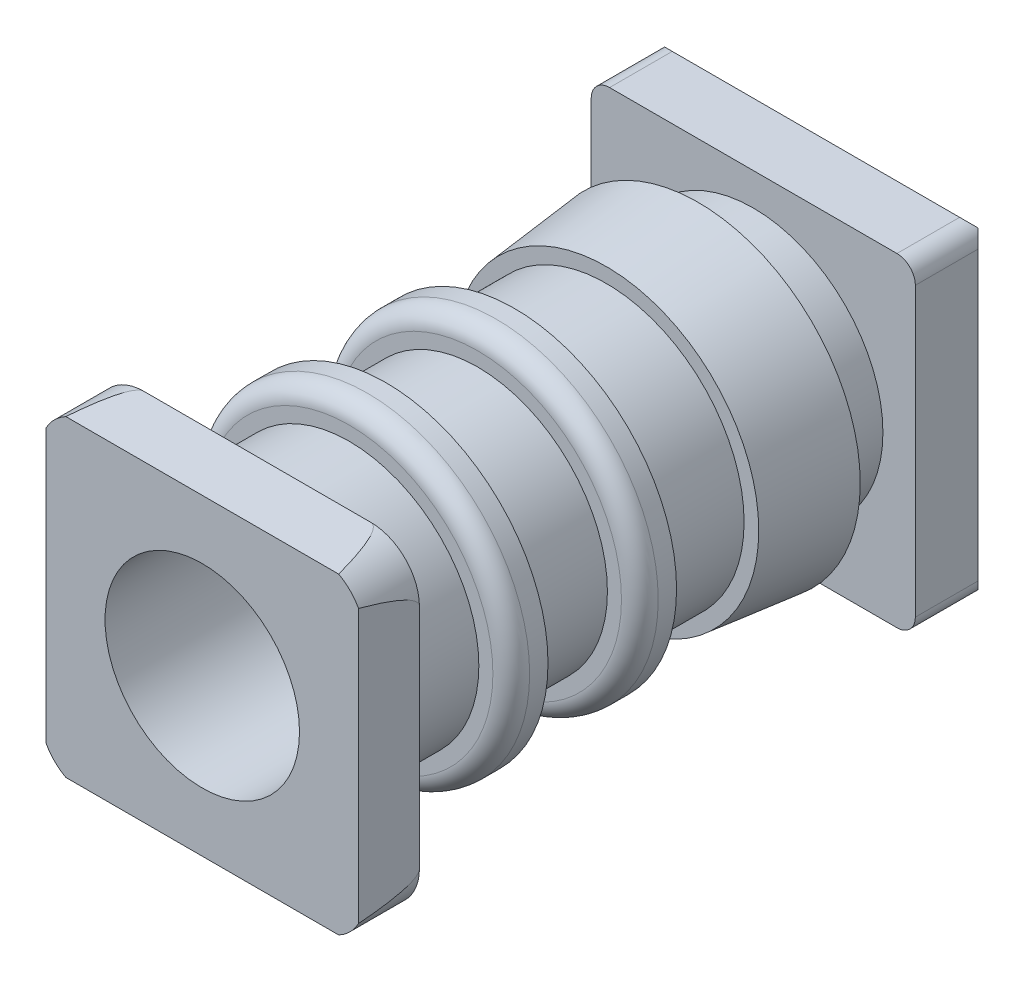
ISO-10303-21;
HEADER;
FILE_DESCRIPTION(('STEP AP214'),'2;1');
FILE_NAME('part.step','',(''),(''),'','','');
FILE_SCHEMA(('AUTOMOTIVE_DESIGN { 1 0 10303 214 1 1 1 1 }'));
ENDSEC;
DATA;
#1=APPLICATION_CONTEXT('core data for automotive mechanical design processes');
#2=APPLICATION_PROTOCOL_DEFINITION('international standard','automotive_design',2000,#1);
#3=PRODUCT_CONTEXT('',#1,'mechanical');
#4=PRODUCT('Part','Part','',(#3));
#5=PRODUCT_RELATED_PRODUCT_CATEGORY('part','',(#4));
#6=PRODUCT_DEFINITION_FORMATION('','',#4);
#7=PRODUCT_DEFINITION_CONTEXT('part definition',#1,'design');
#8=PRODUCT_DEFINITION('design','',#6,#7);
#9=PRODUCT_DEFINITION_SHAPE('','',#8);
#10=(LENGTH_UNIT() NAMED_UNIT(*) SI_UNIT(.MILLI.,.METRE.));
#11=(NAMED_UNIT(*) PLANE_ANGLE_UNIT() SI_UNIT($,.RADIAN.));
#12=(NAMED_UNIT(*) SI_UNIT($,.STERADIAN.) SOLID_ANGLE_UNIT());
#13=UNCERTAINTY_MEASURE_WITH_UNIT(LENGTH_MEASURE(1.E-05),#10,'distance_accuracy_value','');
#14=(GEOMETRIC_REPRESENTATION_CONTEXT(3) GLOBAL_UNCERTAINTY_ASSIGNED_CONTEXT((#13)) GLOBAL_UNIT_ASSIGNED_CONTEXT((#10,
#11,#12)) REPRESENTATION_CONTEXT('',''));
#15=CARTESIAN_POINT('',(0.,0.,0.));
#16=DIRECTION('',(0.,0.,1.));
#17=DIRECTION('',(1.,0.,0.));
#18=AXIS2_PLACEMENT_3D('',#15,#16,#17);
#19=CARTESIAN_POINT('',(-10.,10.,30.6));
#20=DIRECTION('',(0.,0.,-1.));
#21=DIRECTION('',(1.,0.,0.));
#22=AXIS2_PLACEMENT_3D('',#19,#20,#21);
#23=PLANE('',#22);
#24=CARTESIAN_POINT('',(0.,0.,30.6));
#25=DIRECTION('',(0.,0.,-1.));
#26=DIRECTION('',(1.,0.,0.));
#27=AXIS2_PLACEMENT_3D('',#24,#25,#26);
#28=CIRCLE('',#27,8.);
#29=CARTESIAN_POINT('',(8.,0.,30.6));
#30=VERTEX_POINT('',#29);
#31=EDGE_CURVE('E289',#30,#30,#28,.F.);
#32=ORIENTED_EDGE('',*,*,#31,.T.);
#33=EDGE_LOOP('',(#32));
#34=FACE_BOUND('',#33,.T.);
#35=CARTESIAN_POINT('',(7.,-7.,30.6));
#36=DIRECTION('',(0.,0.,-1.));
#37=DIRECTION('',(1.,0.,0.));
#38=AXIS2_PLACEMENT_3D('',#35,#36,#37);
#39=CIRCLE('',#38,3.);
#40=CARTESIAN_POINT('',(7.,-10.,30.6));
#41=VERTEX_POINT('',#40);
#42=CARTESIAN_POINT('',(10.,-7.,30.6));
#43=VERTEX_POINT('',#42);
#44=EDGE_CURVE('E396',#41,#43,#39,.F.);
#45=ORIENTED_EDGE('',*,*,#44,.F.);
#46=DIRECTION('',(-1.,0.,0.));
#47=VECTOR('',#46,1.);
#48=CARTESIAN_POINT('',(-10.,-10.,30.6));
#49=LINE('',#48,#47);
#50=CARTESIAN_POINT('',(-7.,-10.,30.6));
#51=VERTEX_POINT('',#50);
#52=EDGE_CURVE('E239',#51,#41,#49,.F.);
#53=ORIENTED_EDGE('',*,*,#52,.F.);
#54=CARTESIAN_POINT('',(-7.,-7.,30.6));
#55=DIRECTION('',(0.,0.,-1.));
#56=DIRECTION('',(1.,0.,0.));
#57=AXIS2_PLACEMENT_3D('',#54,#55,#56);
#58=CIRCLE('',#57,3.);
#59=CARTESIAN_POINT('',(-10.,-7.,30.6));
#60=VERTEX_POINT('',#59);
#61=EDGE_CURVE('E175',#60,#51,#58,.F.);
#62=ORIENTED_EDGE('',*,*,#61,.F.);
#63=DIRECTION('',(0.,-1.,0.));
#64=VECTOR('',#63,1.);
#65=CARTESIAN_POINT('',(-10.,-10.,30.6));
#66=LINE('',#65,#64);
#67=CARTESIAN_POINT('',(-10.,7.,30.6));
#68=VERTEX_POINT('',#67);
#69=EDGE_CURVE('E241',#60,#68,#66,.F.);
#70=ORIENTED_EDGE('',*,*,#69,.T.);
#71=CARTESIAN_POINT('',(-7.,7.,30.6));
#72=DIRECTION('',(0.,0.,-1.));
#73=DIRECTION('',(1.,0.,0.));
#74=AXIS2_PLACEMENT_3D('',#71,#72,#73);
#75=CIRCLE('',#74,3.);
#76=CARTESIAN_POINT('',(-7.,10.,30.6));
#77=VERTEX_POINT('',#76);
#78=EDGE_CURVE('E31',#77,#68,#75,.F.);
#79=ORIENTED_EDGE('',*,*,#78,.F.);
#80=DIRECTION('',(-1.,0.,0.));
#81=VECTOR('',#80,1.);
#82=CARTESIAN_POINT('',(-10.,10.,30.6));
#83=LINE('',#82,#81);
#84=CARTESIAN_POINT('',(7.,10.,30.6));
#85=VERTEX_POINT('',#84);
#86=EDGE_CURVE('E244',#85,#77,#83,.T.);
#87=ORIENTED_EDGE('',*,*,#86,.F.);
#88=CARTESIAN_POINT('',(7.,7.,30.6));
#89=DIRECTION('',(0.,0.,-1.));
#90=DIRECTION('',(1.,0.,0.));
#91=AXIS2_PLACEMENT_3D('',#88,#89,#90);
#92=CIRCLE('',#91,3.);
#93=CARTESIAN_POINT('',(10.,7.,30.6));
#94=VERTEX_POINT('',#93);
#95=EDGE_CURVE('E413',#94,#85,#92,.F.);
#96=ORIENTED_EDGE('',*,*,#95,.F.);
#97=DIRECTION('',(0.,-1.,0.));
#98=VECTOR('',#97,1.);
#99=CARTESIAN_POINT('',(10.,-10.,30.6));
#100=LINE('',#99,#98);
#101=EDGE_CURVE('E247',#94,#43,#100,.T.);
#102=ORIENTED_EDGE('',*,*,#101,.T.);
#103=EDGE_LOOP('',(#45,#53,#62,#70,#79,#87,#96,#102));
#104=FACE_BOUND('',#103,.T.);
#105=ADVANCED_FACE('F14',(#34,#104),#23,.T.);
#106=CARTESIAN_POINT('',(0.,-4.,34.));
#107=DIRECTION('',(0.,0.,1.));
#108=DIRECTION('',(-1.,0.,0.));
#109=AXIS2_PLACEMENT_3D('',#106,#107,#108);
#110=PLANE('',#109);
#111=CARTESIAN_POINT('',(0.,0.,34.));
#112=DIRECTION('',(0.,0.,-1.));
#113=DIRECTION('',(1.,0.,0.));
#114=AXIS2_PLACEMENT_3D('',#111,#112,#113);
#115=CIRCLE('',#114,6.);
#116=CARTESIAN_POINT('',(6.,0.,34.));
#117=VERTEX_POINT('',#116);
#118=EDGE_CURVE('E417',#117,#117,#115,.T.);
#119=ORIENTED_EDGE('',*,*,#118,.T.);
#120=EDGE_LOOP('',(#119));
#121=FACE_BOUND('',#120,.T.);
#122=CARTESIAN_POINT('',(7.,-7.,34.));
#123=DIRECTION('',(0.,0.,-1.));
#124=DIRECTION('',(-1.,0.,0.));
#125=AXIS2_PLACEMENT_3D('',#122,#123,#124);
#126=CIRCLE('',#125,3.);
#127=CARTESIAN_POINT('',(9.6426456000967,-8.42000853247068,34.));
#128=VERTEX_POINT('',#127);
#129=CARTESIAN_POINT('',(8.42000853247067,-9.6426456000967,34.));
#130=VERTEX_POINT('',#129);
#131=EDGE_CURVE('E38',#128,#130,#126,.T.);
#132=ORIENTED_EDGE('',*,*,#131,.F.);
#133=DIRECTION('',(0.,-1.,0.));
#134=VECTOR('',#133,1.);
#135=CARTESIAN_POINT('',(9.6426456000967,-4.,34.));
#136=LINE('',#135,#134);
#137=CARTESIAN_POINT('',(9.6426456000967,8.42000853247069,34.));
#138=VERTEX_POINT('',#137);
#139=EDGE_CURVE('E205',#128,#138,#136,.F.);
#140=ORIENTED_EDGE('',*,*,#139,.T.);
#141=CARTESIAN_POINT('',(7.,7.,34.));
#142=DIRECTION('',(0.,0.,1.));
#143=DIRECTION('',(-1.,0.,0.));
#144=AXIS2_PLACEMENT_3D('',#141,#142,#143);
#145=CIRCLE('',#144,3.);
#146=CARTESIAN_POINT('',(8.42000853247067,9.64264560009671,34.));
#147=VERTEX_POINT('',#146);
#148=EDGE_CURVE('E180',#147,#138,#145,.F.);
#149=ORIENTED_EDGE('',*,*,#148,.F.);
#150=DIRECTION('',(-1.,0.,0.));
#151=VECTOR('',#150,1.);
#152=CARTESIAN_POINT('',(0.,9.64264560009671,34.));
#153=LINE('',#152,#151);
#154=CARTESIAN_POINT('',(-8.42000853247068,9.6426456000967,34.));
#155=VERTEX_POINT('',#154);
#156=EDGE_CURVE('E197',#147,#155,#153,.T.);
#157=ORIENTED_EDGE('',*,*,#156,.T.);
#158=CARTESIAN_POINT('',(-7.,7.,34.));
#159=DIRECTION('',(0.,0.,-1.));
#160=DIRECTION('',(-1.,0.,0.));
#161=AXIS2_PLACEMENT_3D('',#158,#159,#160);
#162=CIRCLE('',#161,3.);
#163=CARTESIAN_POINT('',(-9.6426456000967,8.42000853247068,34.));
#164=VERTEX_POINT('',#163);
#165=EDGE_CURVE('E190',#164,#155,#162,.T.);
#166=ORIENTED_EDGE('',*,*,#165,.F.);
#167=DIRECTION('',(0.,-1.,0.));
#168=VECTOR('',#167,1.);
#169=CARTESIAN_POINT('',(-9.6426456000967,-4.,34.));
#170=LINE('',#169,#168);
#171=CARTESIAN_POINT('',(-9.6426456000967,-8.42000853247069,34.));
#172=VERTEX_POINT('',#171);
#173=EDGE_CURVE('E189',#164,#172,#170,.T.);
#174=ORIENTED_EDGE('',*,*,#173,.T.);
#175=CARTESIAN_POINT('',(-7.,-7.,34.));
#176=DIRECTION('',(0.,0.,-1.));
#177=DIRECTION('',(-1.,0.,0.));
#178=AXIS2_PLACEMENT_3D('',#175,#176,#177);
#179=CIRCLE('',#178,3.);
#180=CARTESIAN_POINT('',(-8.42000853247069,-9.6426456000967,34.));
#181=VERTEX_POINT('',#180);
#182=EDGE_CURVE('E172',#181,#172,#179,.T.);
#183=ORIENTED_EDGE('',*,*,#182,.F.);
#184=DIRECTION('',(-1.,0.,0.));
#185=VECTOR('',#184,1.);
#186=CARTESIAN_POINT('',(0.,-9.6426456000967,34.));
#187=LINE('',#186,#185);
#188=EDGE_CURVE('E186',#181,#130,#187,.F.);
#189=ORIENTED_EDGE('',*,*,#188,.T.);
#190=EDGE_LOOP('',(#132,#140,#149,#157,#166,#174,#183,#189));
#191=FACE_BOUND('',#190,.T.);
#192=ADVANCED_FACE('F185',(#121,#191),#110,.T.);
#193=CARTESIAN_POINT('',(0.,0.,15.8666666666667));
#194=DIRECTION('',(0.,0.,1.));
#195=DIRECTION('',(-1.,0.,0.));
#196=AXIS2_PLACEMENT_3D('',#193,#194,#195);
#197=TOROIDAL_SURFACE('',#196,8.86666666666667,1.13333333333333);
#198=CARTESIAN_POINT('',(0.,0.,15.8666666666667));
#199=DIRECTION('',(0.,0.,-1.));
#200=DIRECTION('',(1.,0.,0.));
#201=AXIS2_PLACEMENT_3D('',#198,#199,#200);
#202=CIRCLE('',#201,10.);
#203=CARTESIAN_POINT('',(10.,0.,15.8666666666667));
#204=VERTEX_POINT('',#203);
#205=EDGE_CURVE('E419',#204,#204,#202,.T.);
#206=ORIENTED_EDGE('',*,*,#205,.F.);
#207=EDGE_LOOP('',(#206));
#208=FACE_BOUND('',#207,.T.);
#209=CARTESIAN_POINT('',(0.,0.,17.));
#210=DIRECTION('',(0.,0.,-1.));
#211=DIRECTION('',(1.,0.,0.));
#212=AXIS2_PLACEMENT_3D('',#209,#210,#211);
#213=CIRCLE('',#212,8.86666666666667);
#214=CARTESIAN_POINT('',(0.,-8.86666666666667,17.));
#215=VERTEX_POINT('',#214);
#216=CARTESIAN_POINT('',(8.86666666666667,0.,17.));
#217=VERTEX_POINT('',#216);
#218=EDGE_CURVE('E423',#215,#217,#213,.F.);
#219=ORIENTED_EDGE('',*,*,#218,.F.);
#220=CARTESIAN_POINT('',(0.,0.,17.));
#221=DIRECTION('',(0.,0.,-1.));
#222=DIRECTION('',(0.,-1.,0.));
#223=AXIS2_PLACEMENT_3D('',#220,#221,#222);
#224=CIRCLE('',#223,8.86666666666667);
#225=CARTESIAN_POINT('',(-8.86666666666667,0.,17.));
#226=VERTEX_POINT('',#225);
#227=EDGE_CURVE('E516',#226,#215,#224,.F.);
#228=ORIENTED_EDGE('',*,*,#227,.F.);
#229=CARTESIAN_POINT('',(0.,0.,17.));
#230=DIRECTION('',(0.,0.,-1.));
#231=DIRECTION('',(-1.,0.,0.));
#232=AXIS2_PLACEMENT_3D('',#229,#230,#231);
#233=CIRCLE('',#232,8.86666666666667);
#234=EDGE_CURVE('E384',#217,#226,#233,.F.);
#235=ORIENTED_EDGE('',*,*,#234,.F.);
#236=EDGE_LOOP('',(#219,#228,#235));
#237=FACE_BOUND('',#236,.T.);
#238=ADVANCED_FACE('F16',(#208,#237),#197,.T.);
#239=CARTESIAN_POINT('',(0.,0.,15.3));
#240=DIRECTION('',(0.,0.,-1.));
#241=DIRECTION('',(1.,0.,0.));
#242=AXIS2_PLACEMENT_3D('',#239,#240,#241);
#243=CYLINDRICAL_SURFACE('',#242,10.);
#244=ORIENTED_EDGE('',*,*,#205,.T.);
#245=EDGE_LOOP('',(#244));
#246=FACE_BOUND('',#245,.T.);
#247=CARTESIAN_POINT('',(0.,0.,14.7333333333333));
#248=DIRECTION('',(0.,0.,-1.));
#249=DIRECTION('',(1.,0.,0.));
#250=AXIS2_PLACEMENT_3D('',#247,#248,#249);
#251=CIRCLE('',#250,10.);
#252=CARTESIAN_POINT('',(10.,0.,14.7333333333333));
#253=VERTEX_POINT('',#252);
#254=EDGE_CURVE('E514',#253,#253,#251,.T.);
#255=ORIENTED_EDGE('',*,*,#254,.F.);
#256=EDGE_LOOP('',(#255));
#257=FACE_BOUND('',#256,.T.);
#258=ADVANCED_FACE('F539',(#246,#257),#243,.T.);
#259=CARTESIAN_POINT('',(0.,-8.43333333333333,17.));
#260=DIRECTION('',(0.,0.,1.));
#261=DIRECTION('',(-1.,0.,0.));
#262=AXIS2_PLACEMENT_3D('',#259,#260,#261);
#263=PLANE('',#262);
#264=ORIENTED_EDGE('',*,*,#234,.T.);
#265=ORIENTED_EDGE('',*,*,#227,.T.);
#266=ORIENTED_EDGE('',*,*,#218,.T.);
#267=EDGE_LOOP('',(#264,#265,#266));
#268=FACE_BOUND('',#267,.T.);
#269=CARTESIAN_POINT('',(0.,0.,17.));
#270=DIRECTION('',(0.,0.,-1.));
#271=DIRECTION('',(1.,0.,0.));
#272=AXIS2_PLACEMENT_3D('',#269,#270,#271);
#273=CIRCLE('',#272,8.);
#274=CARTESIAN_POINT('',(8.,0.,17.));
#275=VERTEX_POINT('',#274);
#276=EDGE_CURVE('E512',#275,#275,#273,.F.);
#277=ORIENTED_EDGE('',*,*,#276,.F.);
#278=EDGE_LOOP('',(#277));
#279=FACE_BOUND('',#278,.T.);
#280=ADVANCED_FACE('F522',(#268,#279),#263,.T.);
#281=CARTESIAN_POINT('',(0.,-9.25,14.7333333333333));
#282=DIRECTION('',(0.,0.,-1.));
#283=DIRECTION('',(1.,0.,0.));
#284=AXIS2_PLACEMENT_3D('',#281,#282,#283);
#285=PLANE('',#284);
#286=CARTESIAN_POINT('',(0.,0.,14.7333333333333));
#287=DIRECTION('',(0.,0.,-1.));
#288=DIRECTION('',(1.,0.,0.));
#289=AXIS2_PLACEMENT_3D('',#286,#287,#288);
#290=CIRCLE('',#289,8.5);
#291=CARTESIAN_POINT('',(8.5,0.,14.7333333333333));
#292=VERTEX_POINT('',#291);
#293=EDGE_CURVE('E509',#292,#292,#290,.T.);
#294=ORIENTED_EDGE('',*,*,#293,.F.);
#295=EDGE_LOOP('',(#294));
#296=FACE_BOUND('',#295,.T.);
#297=ORIENTED_EDGE('',*,*,#254,.T.);
#298=EDGE_LOOP('',(#297));
#299=FACE_BOUND('',#298,.T.);
#300=ADVANCED_FACE('F538',(#296,#299),#285,.T.);
#301=CARTESIAN_POINT('',(0.,0.,19.8333333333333));
#302=DIRECTION('',(0.,0.,-1.));
#303=DIRECTION('',(1.,0.,0.));
#304=AXIS2_PLACEMENT_3D('',#301,#302,#303);
#305=CYLINDRICAL_SURFACE('',#304,8.);
#306=CARTESIAN_POINT('',(0.,0.,22.6666666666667));
#307=DIRECTION('',(0.,0.,-1.));
#308=DIRECTION('',(1.,0.,0.));
#309=AXIS2_PLACEMENT_3D('',#306,#307,#308);
#310=CIRCLE('',#309,8.);
#311=CARTESIAN_POINT('',(8.,0.,22.6666666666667));
#312=VERTEX_POINT('',#311);
#313=EDGE_CURVE('E506',#312,#312,#310,.F.);
#314=ORIENTED_EDGE('',*,*,#313,.F.);
#315=EDGE_LOOP('',(#314));
#316=FACE_BOUND('',#315,.T.);
#317=ORIENTED_EDGE('',*,*,#276,.T.);
#318=EDGE_LOOP('',(#317));
#319=FACE_BOUND('',#318,.T.);
#320=ADVANCED_FACE('F682',(#316,#319),#305,.T.);
#321=CARTESIAN_POINT('',(0.,0.,11.9));
#322=DIRECTION('',(0.,0.,-1.));
#323=DIRECTION('',(1.,0.,0.));
#324=AXIS2_PLACEMENT_3D('',#321,#322,#323);
#325=CYLINDRICAL_SURFACE('',#324,8.5);
#326=ORIENTED_EDGE('',*,*,#293,.T.);
#327=EDGE_LOOP('',(#326));
#328=FACE_BOUND('',#327,.T.);
#329=CARTESIAN_POINT('',(0.,0.,9.0666666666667));
#330=DIRECTION('',(0.,0.,-1.));
#331=DIRECTION('',(1.,0.,0.));
#332=AXIS2_PLACEMENT_3D('',#329,#330,#331);
#333=CIRCLE('',#332,8.5);
#334=CARTESIAN_POINT('',(8.5,0.,9.0666666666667));
#335=VERTEX_POINT('',#334);
#336=EDGE_CURVE('E503',#335,#335,#333,.T.);
#337=ORIENTED_EDGE('',*,*,#336,.F.);
#338=EDGE_LOOP('',(#337));
#339=FACE_BOUND('',#338,.T.);
#340=ADVANCED_FACE('F680',(#328,#339),#325,.T.);
#341=CARTESIAN_POINT('',(0.,-9.,22.6666666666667));
#342=DIRECTION('',(0.,0.,-1.));
#343=DIRECTION('',(1.,0.,0.));
#344=AXIS2_PLACEMENT_3D('',#341,#342,#343);
#345=PLANE('',#344);
#346=ORIENTED_EDGE('',*,*,#313,.T.);
#347=EDGE_LOOP('',(#346));
#348=FACE_BOUND('',#347,.T.);
#349=CARTESIAN_POINT('',(0.,0.,22.6666666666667));
#350=DIRECTION('',(0.,0.,-1.));
#351=DIRECTION('',(1.,0.,0.));
#352=AXIS2_PLACEMENT_3D('',#349,#350,#351);
#353=CIRCLE('',#352,10.);
#354=CARTESIAN_POINT('',(10.,0.,22.6666666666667));
#355=VERTEX_POINT('',#354);
#356=EDGE_CURVE('E500',#355,#355,#353,.F.);
#357=ORIENTED_EDGE('',*,*,#356,.F.);
#358=EDGE_LOOP('',(#357));
#359=FACE_BOUND('',#358,.T.);
#360=ADVANCED_FACE('F676',(#348,#359),#345,.T.);
#361=CARTESIAN_POINT('',(0.,-8.95220466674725,9.0666666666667));
#362=DIRECTION('',(0.,0.,1.));
#363=DIRECTION('',(0.,1.,0.));
#364=AXIS2_PLACEMENT_3D('',#361,#362,#363);
#365=PLANE('',#364);
#366=CARTESIAN_POINT('',(0.,0.,9.0666666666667));
#367=DIRECTION('',(0.,0.,-1.));
#368=DIRECTION('',(1.,0.,0.));
#369=AXIS2_PLACEMENT_3D('',#366,#367,#368);
#370=CIRCLE('',#369,9.40440933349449);
#371=CARTESIAN_POINT('',(9.40440933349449,0.,9.0666666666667));
#372=VERTEX_POINT('',#371);
#373=EDGE_CURVE('E497',#372,#372,#370,.T.);
#374=ORIENTED_EDGE('',*,*,#373,.F.);
#375=EDGE_LOOP('',(#374));
#376=FACE_BOUND('',#375,.T.);
#377=ORIENTED_EDGE('',*,*,#336,.T.);
#378=EDGE_LOOP('',(#377));
#379=FACE_BOUND('',#378,.T.);
#380=ADVANCED_FACE('F670',(#376,#379),#365,.T.);
#381=CARTESIAN_POINT('',(0.,0.,23.2333333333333));
#382=DIRECTION('',(0.,0.,-1.));
#383=DIRECTION('',(1.,0.,0.));
#384=AXIS2_PLACEMENT_3D('',#381,#382,#383);
#385=CYLINDRICAL_SURFACE('',#384,10.);
#386=ORIENTED_EDGE('',*,*,#356,.T.);
#387=EDGE_LOOP('',(#386));
#388=FACE_BOUND('',#387,.T.);
#389=CARTESIAN_POINT('',(0.,0.,23.8));
#390=DIRECTION('',(0.,0.,1.));
#391=DIRECTION('',(-1.,0.,0.));
#392=AXIS2_PLACEMENT_3D('',#389,#390,#391);
#393=CIRCLE('',#392,10.);
#394=CARTESIAN_POINT('',(-10.,0.,23.8));
#395=VERTEX_POINT('',#394);
#396=EDGE_CURVE('E353',#395,#395,#393,.T.);
#397=ORIENTED_EDGE('',*,*,#396,.F.);
#398=EDGE_LOOP('',(#397));
#399=FACE_BOUND('',#398,.T.);
#400=ADVANCED_FACE('F664',(#388,#399),#385,.T.);
#401=CARTESIAN_POINT('',(0.,0.,3.4));
#402=DIRECTION('',(0.,0.,-1.));
#403=DIRECTION('',(1.,0.,0.));
#404=AXIS2_PLACEMENT_3D('',#401,#402,#403);
#405=CONICAL_SURFACE('',#404,10.,0.10471975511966);
#406=ORIENTED_EDGE('',*,*,#373,.T.);
#407=EDGE_LOOP('',(#406));
#408=FACE_BOUND('',#407,.T.);
#409=CARTESIAN_POINT('',(0.,0.,3.4));
#410=DIRECTION('',(0.,0.,-1.));
#411=DIRECTION('',(1.,0.,0.));
#412=AXIS2_PLACEMENT_3D('',#409,#410,#411);
#413=CIRCLE('',#412,10.);
#414=CARTESIAN_POINT('',(10.,0.,3.4));
#415=VERTEX_POINT('',#414);
#416=EDGE_CURVE('E345',#415,#415,#413,.T.);
#417=ORIENTED_EDGE('',*,*,#416,.F.);
#418=EDGE_LOOP('',(#417));
#419=FACE_BOUND('',#418,.T.);
#420=ADVANCED_FACE('F363',(#408,#419),#405,.T.);
#421=CARTESIAN_POINT('',(0.,0.,23.8));
#422=DIRECTION('',(0.,0.,1.));
#423=DIRECTION('',(-1.,0.,0.));
#424=AXIS2_PLACEMENT_3D('',#421,#422,#423);
#425=TOROIDAL_SURFACE('',#424,8.86666666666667,1.13333333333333);
#426=ORIENTED_EDGE('',*,*,#396,.T.);
#427=EDGE_LOOP('',(#426));
#428=FACE_BOUND('',#427,.T.);
#429=CARTESIAN_POINT('',(0.,0.,24.9333333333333));
#430=DIRECTION('',(0.,0.,-1.));
#431=DIRECTION('',(1.,0.,0.));
#432=AXIS2_PLACEMENT_3D('',#429,#430,#431);
#433=CIRCLE('',#432,8.86666666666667);
#434=CARTESIAN_POINT('',(0.,-8.86666666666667,24.9333333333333));
#435=VERTEX_POINT('',#434);
#436=CARTESIAN_POINT('',(8.86666666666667,0.,24.9333333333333));
#437=VERTEX_POINT('',#436);
#438=EDGE_CURVE('E300',#435,#437,#433,.F.);
#439=ORIENTED_EDGE('',*,*,#438,.F.);
#440=CARTESIAN_POINT('',(0.,0.,24.9333333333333));
#441=DIRECTION('',(0.,0.,-1.));
#442=DIRECTION('',(0.,-1.,0.));
#443=AXIS2_PLACEMENT_3D('',#440,#441,#442);
#444=CIRCLE('',#443,8.86666666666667);
#445=CARTESIAN_POINT('',(-8.86666666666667,0.,24.9333333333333));
#446=VERTEX_POINT('',#445);
#447=EDGE_CURVE('E336',#446,#435,#444,.F.);
#448=ORIENTED_EDGE('',*,*,#447,.F.);
#449=CARTESIAN_POINT('',(0.,0.,24.9333333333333));
#450=DIRECTION('',(0.,0.,-1.));
#451=DIRECTION('',(-1.,0.,0.));
#452=AXIS2_PLACEMENT_3D('',#449,#450,#451);
#453=CIRCLE('',#452,8.86666666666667);
#454=EDGE_CURVE('E338',#437,#446,#453,.F.);
#455=ORIENTED_EDGE('',*,*,#454,.F.);
#456=EDGE_LOOP('',(#439,#448,#455));
#457=FACE_BOUND('',#456,.T.);
#458=ADVANCED_FACE('F343',(#428,#457),#425,.T.);
#459=CARTESIAN_POINT('',(0.,-9.,3.4));
#460=DIRECTION('',(0.,0.,-1.));
#461=DIRECTION('',(1.,0.,0.));
#462=AXIS2_PLACEMENT_3D('',#459,#460,#461);
#463=PLANE('',#462);
#464=CARTESIAN_POINT('',(0.,0.,3.4));
#465=DIRECTION('',(0.,0.,-1.));
#466=DIRECTION('',(1.,0.,0.));
#467=AXIS2_PLACEMENT_3D('',#464,#465,#466);
#468=CIRCLE('',#467,8.);
#469=CARTESIAN_POINT('',(8.,0.,3.4));
#470=VERTEX_POINT('',#469);
#471=EDGE_CURVE('E341',#470,#470,#468,.T.);
#472=ORIENTED_EDGE('',*,*,#471,.F.);
#473=EDGE_LOOP('',(#472));
#474=FACE_BOUND('',#473,.T.);
#475=ORIENTED_EDGE('',*,*,#416,.T.);
#476=EDGE_LOOP('',(#475));
#477=FACE_BOUND('',#476,.T.);
#478=ADVANCED_FACE('F318',(#474,#477),#463,.T.);
#479=CARTESIAN_POINT('',(0.,-8.43333333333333,24.9333333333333));
#480=DIRECTION('',(0.,0.,1.));
#481=DIRECTION('',(-1.,0.,0.));
#482=AXIS2_PLACEMENT_3D('',#479,#480,#481);
#483=PLANE('',#482);
#484=ORIENTED_EDGE('',*,*,#454,.T.);
#485=ORIENTED_EDGE('',*,*,#447,.T.);
#486=ORIENTED_EDGE('',*,*,#438,.T.);
#487=EDGE_LOOP('',(#484,#485,#486));
#488=FACE_BOUND('',#487,.T.);
#489=CARTESIAN_POINT('',(0.,0.,24.9333333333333));
#490=DIRECTION('',(0.,0.,-1.));
#491=DIRECTION('',(1.,0.,0.));
#492=AXIS2_PLACEMENT_3D('',#489,#490,#491);
#493=CIRCLE('',#492,8.);
#494=CARTESIAN_POINT('',(8.,0.,24.9333333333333));
#495=VERTEX_POINT('',#494);
#496=EDGE_CURVE('E490',#495,#495,#493,.F.);
#497=ORIENTED_EDGE('',*,*,#496,.F.);
#498=EDGE_LOOP('',(#497));
#499=FACE_BOUND('',#498,.T.);
#500=ADVANCED_FACE('F307',(#488,#499),#483,.T.);
#501=CARTESIAN_POINT('',(0.,0.,-0.8));
#502=DIRECTION('',(0.,0.,-1.));
#503=DIRECTION('',(1.,0.,0.));
#504=AXIS2_PLACEMENT_3D('',#501,#502,#503);
#505=CYLINDRICAL_SURFACE('',#504,8.);
#506=CARTESIAN_POINT('',(0.,0.,0.));
#507=DIRECTION('',(0.,0.,-1.));
#508=DIRECTION('',(1.,0.,0.));
#509=AXIS2_PLACEMENT_3D('',#506,#507,#508);
#510=CIRCLE('',#509,8.);
#511=CARTESIAN_POINT('',(8.,0.,0.));
#512=VERTEX_POINT('',#511);
#513=EDGE_CURVE('E583',#512,#512,#510,.T.);
#514=ORIENTED_EDGE('',*,*,#513,.F.);
#515=EDGE_LOOP('',(#514));
#516=FACE_BOUND('',#515,.T.);
#517=ORIENTED_EDGE('',*,*,#471,.T.);
#518=EDGE_LOOP('',(#517));
#519=FACE_BOUND('',#518,.T.);
#520=ADVANCED_FACE('F317',(#516,#519),#505,.T.);
#521=CARTESIAN_POINT('',(0.,0.,29.4666666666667));
#522=DIRECTION('',(0.,0.,-1.));
#523=DIRECTION('',(1.,0.,0.));
#524=AXIS2_PLACEMENT_3D('',#521,#522,#523);
#525=CYLINDRICAL_SURFACE('',#524,8.);
#526=ORIENTED_EDGE('',*,*,#31,.F.);
#527=EDGE_LOOP('',(#526));
#528=FACE_BOUND('',#527,.T.);
#529=ORIENTED_EDGE('',*,*,#496,.T.);
#530=EDGE_LOOP('',(#529));
#531=FACE_BOUND('',#530,.T.);
#532=ADVANCED_FACE('F641',(#528,#531),#525,.T.);
#533=CARTESIAN_POINT('',(-8.86666666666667,8.86666666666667,-5.));
#534=DIRECTION('',(0.,0.,-1.));
#535=DIRECTION('',(1.,0.,0.));
#536=AXIS2_PLACEMENT_3D('',#533,#534,#535);
#537=CYLINDRICAL_SURFACE('',#536,1.13333333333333);
#538=DIRECTION('',(0.,0.,1.));
#539=VECTOR('',#538,1.);
#540=CARTESIAN_POINT('',(-8.86666666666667,10.,-5.));
#541=LINE('',#540,#539);
#542=CARTESIAN_POINT('',(-8.86666666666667,10.,-3.86666666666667));
#543=VERTEX_POINT('',#542);
#544=CARTESIAN_POINT('',(-8.86666666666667,10.,0.));
#545=VERTEX_POINT('',#544);
#546=EDGE_CURVE('E280',#543,#545,#541,.T.);
#547=ORIENTED_EDGE('',*,*,#546,.F.);
#548=CARTESIAN_POINT('',(-8.86666666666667,8.86666666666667,-5.));
#549=DIRECTION('',(0.,-0.707106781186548,0.707106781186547));
#550=DIRECTION('',(0.,-0.707106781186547,-0.707106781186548));
#551=AXIS2_PLACEMENT_3D('',#548,#549,#550);
#552=ELLIPSE('',#551,1.6027753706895,1.13333333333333);
#553=CARTESIAN_POINT('',(-9.66805435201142,9.66805435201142,-4.19861231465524));
#554=VERTEX_POINT('',#553);
#555=EDGE_CURVE('E466',#543,#554,#552,.T.);
#556=ORIENTED_EDGE('',*,*,#555,.T.);
#557=CARTESIAN_POINT('',(-8.86666666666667,8.86666666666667,-5.));
#558=DIRECTION('',(0.707106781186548,0.,0.707106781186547));
#559=DIRECTION('',(0.707106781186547,0.,-0.707106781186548));
#560=AXIS2_PLACEMENT_3D('',#557,#558,#559);
#561=ELLIPSE('',#560,1.6027753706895,1.13333333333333);
#562=CARTESIAN_POINT('',(-10.,8.86666666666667,-3.86666666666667));
#563=VERTEX_POINT('',#562);
#564=EDGE_CURVE('E457',#554,#563,#561,.T.);
#565=ORIENTED_EDGE('',*,*,#564,.T.);
#566=DIRECTION('',(0.,0.,1.));
#567=VECTOR('',#566,1.);
#568=CARTESIAN_POINT('',(-10.,8.86666666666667,-5.));
#569=LINE('',#568,#567);
#570=CARTESIAN_POINT('',(-10.,8.86666666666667,0.));
#571=VERTEX_POINT('',#570);
#572=EDGE_CURVE('E282',#571,#563,#569,.F.);
#573=ORIENTED_EDGE('',*,*,#572,.F.);
#574=CARTESIAN_POINT('',(-8.86666666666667,8.86666666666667,0.));
#575=DIRECTION('',(0.,0.,-1.));
#576=DIRECTION('',(1.,0.,0.));
#577=AXIS2_PLACEMENT_3D('',#574,#575,#576);
#578=CIRCLE('',#577,1.13333333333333);
#579=EDGE_CURVE('E587',#545,#571,#578,.F.);
#580=ORIENTED_EDGE('',*,*,#579,.F.);
#581=EDGE_LOOP('',(#547,#556,#565,#573,#580));
#582=FACE_BOUND('',#581,.T.);
#583=ADVANCED_FACE('F597',(#582),#537,.T.);
#584=CARTESIAN_POINT('',(8.86666666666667,8.86666666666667,-5.));
#585=DIRECTION('',(0.,0.,-1.));
#586=DIRECTION('',(1.,0.,0.));
#587=AXIS2_PLACEMENT_3D('',#584,#585,#586);
#588=CYLINDRICAL_SURFACE('',#587,1.13333333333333);
#589=CARTESIAN_POINT('',(8.86666666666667,8.86666666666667,0.));
#590=DIRECTION('',(0.,0.,-1.));
#591=DIRECTION('',(1.,0.,0.));
#592=AXIS2_PLACEMENT_3D('',#589,#590,#591);
#593=CIRCLE('',#592,1.13333333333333);
#594=CARTESIAN_POINT('',(10.,8.86666666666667,0.));
#595=VERTEX_POINT('',#594);
#596=CARTESIAN_POINT('',(8.86666666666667,10.,0.));
#597=VERTEX_POINT('',#596);
#598=EDGE_CURVE('E471',#595,#597,#593,.F.);
#599=ORIENTED_EDGE('',*,*,#598,.F.);
#600=DIRECTION('',(0.,0.,1.));
#601=VECTOR('',#600,1.);
#602=CARTESIAN_POINT('',(10.,8.86666666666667,-5.));
#603=LINE('',#602,#601);
#604=CARTESIAN_POINT('',(10.,8.86666666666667,-3.86666666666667));
#605=VERTEX_POINT('',#604);
#606=EDGE_CURVE('E274',#605,#595,#603,.T.);
#607=ORIENTED_EDGE('',*,*,#606,.F.);
#608=CARTESIAN_POINT('',(8.86666666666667,8.86666666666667,-5.));
#609=DIRECTION('',(-0.707106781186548,0.,0.707106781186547));
#610=DIRECTION('',(-0.707106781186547,0.,-0.707106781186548));
#611=AXIS2_PLACEMENT_3D('',#608,#609,#610);
#612=ELLIPSE('',#611,1.6027753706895,1.13333333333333);
#613=CARTESIAN_POINT('',(9.66805435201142,9.66805435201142,-4.19861231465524));
#614=VERTEX_POINT('',#613);
#615=EDGE_CURVE('E463',#605,#614,#612,.T.);
#616=ORIENTED_EDGE('',*,*,#615,.T.);
#617=CARTESIAN_POINT('',(8.86666666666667,8.86666666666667,-5.));
#618=DIRECTION('',(0.,-0.707106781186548,0.707106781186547));
#619=DIRECTION('',(0.,-0.707106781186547,-0.707106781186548));
#620=AXIS2_PLACEMENT_3D('',#617,#618,#619);
#621=ELLIPSE('',#620,1.6027753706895,1.13333333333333);
#622=CARTESIAN_POINT('',(8.86666666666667,10.,-3.86666666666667));
#623=VERTEX_POINT('',#622);
#624=EDGE_CURVE('E462',#614,#623,#621,.T.);
#625=ORIENTED_EDGE('',*,*,#624,.T.);
#626=DIRECTION('',(0.,0.,1.));
#627=VECTOR('',#626,1.);
#628=CARTESIAN_POINT('',(8.86666666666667,10.,-5.));
#629=LINE('',#628,#627);
#630=EDGE_CURVE('E276',#597,#623,#629,.F.);
#631=ORIENTED_EDGE('',*,*,#630,.F.);
#632=EDGE_LOOP('',(#599,#607,#616,#625,#631));
#633=FACE_BOUND('',#632,.T.);
#634=ADVANCED_FACE('F469',(#633),#588,.T.);
#635=CARTESIAN_POINT('',(8.86666666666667,-8.86666666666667,-5.));
#636=DIRECTION('',(0.,0.,-1.));
#637=DIRECTION('',(1.,0.,0.));
#638=AXIS2_PLACEMENT_3D('',#635,#636,#637);
#639=CYLINDRICAL_SURFACE('',#638,1.13333333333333);
#640=DIRECTION('',(0.,0.,1.));
#641=VECTOR('',#640,1.);
#642=CARTESIAN_POINT('',(8.86666666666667,-10.,-5.));
#643=LINE('',#642,#641);
#644=CARTESIAN_POINT('',(8.86666666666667,-10.,-3.86666666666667));
#645=VERTEX_POINT('',#644);
#646=CARTESIAN_POINT('',(8.86666666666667,-10.,0.));
#647=VERTEX_POINT('',#646);
#648=EDGE_CURVE('E265',#645,#647,#643,.T.);
#649=ORIENTED_EDGE('',*,*,#648,.F.);
#650=CARTESIAN_POINT('',(8.86666666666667,-8.86666666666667,-5.));
#651=DIRECTION('',(0.,0.707106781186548,0.707106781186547));
#652=DIRECTION('',(0.,0.707106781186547,-0.707106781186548));
#653=AXIS2_PLACEMENT_3D('',#650,#651,#652);
#654=ELLIPSE('',#653,1.6027753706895,1.13333333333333);
#655=CARTESIAN_POINT('',(9.66805435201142,-9.66805435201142,-4.19861231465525));
#656=VERTEX_POINT('',#655);
#657=EDGE_CURVE('E482',#645,#656,#654,.T.);
#658=ORIENTED_EDGE('',*,*,#657,.T.);
#659=CARTESIAN_POINT('',(8.86666666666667,-8.86666666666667,-5.));
#660=DIRECTION('',(-0.707106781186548,0.,0.707106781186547));
#661=DIRECTION('',(-0.707106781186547,0.,-0.707106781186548));
#662=AXIS2_PLACEMENT_3D('',#659,#660,#661);
#663=ELLIPSE('',#662,1.6027753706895,1.13333333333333);
#664=CARTESIAN_POINT('',(10.,-8.86666666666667,-3.86666666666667));
#665=VERTEX_POINT('',#664);
#666=EDGE_CURVE('E445',#656,#665,#663,.T.);
#667=ORIENTED_EDGE('',*,*,#666,.T.);
#668=DIRECTION('',(0.,0.,1.));
#669=VECTOR('',#668,1.);
#670=CARTESIAN_POINT('',(10.,-8.86666666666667,-5.));
#671=LINE('',#670,#669);
#672=CARTESIAN_POINT('',(10.,-8.86666666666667,0.));
#673=VERTEX_POINT('',#672);
#674=EDGE_CURVE('E267',#673,#665,#671,.F.);
#675=ORIENTED_EDGE('',*,*,#674,.F.);
#676=CARTESIAN_POINT('',(8.86666666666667,-8.86666666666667,0.));
#677=DIRECTION('',(0.,0.,-1.));
#678=DIRECTION('',(1.,0.,0.));
#679=AXIS2_PLACEMENT_3D('',#676,#677,#678);
#680=CIRCLE('',#679,1.13333333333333);
#681=EDGE_CURVE('E480',#647,#673,#680,.F.);
#682=ORIENTED_EDGE('',*,*,#681,.F.);
#683=EDGE_LOOP('',(#649,#658,#667,#675,#682));
#684=FACE_BOUND('',#683,.T.);
#685=ADVANCED_FACE('F479',(#684),#639,.T.);
#686=CARTESIAN_POINT('',(0.,0.,0.));
#687=DIRECTION('',(0.,0.,1.));
#688=DIRECTION('',(-1.,0.,0.));
#689=AXIS2_PLACEMENT_3D('',#686,#687,#688);
#690=PLANE('',#689);
#691=ORIENTED_EDGE('',*,*,#513,.T.);
#692=EDGE_LOOP('',(#691));
#693=FACE_BOUND('',#692,.T.);
#694=ORIENTED_EDGE('',*,*,#681,.T.);
#695=DIRECTION('',(0.,1.,0.));
#696=VECTOR('',#695,1.);
#697=CARTESIAN_POINT('',(10.,8.86666666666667,0.));
#698=LINE('',#697,#696);
#699=EDGE_CURVE('E273',#595,#673,#698,.F.);
#700=ORIENTED_EDGE('',*,*,#699,.F.);
#701=ORIENTED_EDGE('',*,*,#598,.T.);
#702=DIRECTION('',(-1.,0.,0.));
#703=VECTOR('',#702,1.);
#704=CARTESIAN_POINT('',(-8.86666666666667,10.,0.));
#705=LINE('',#704,#703);
#706=EDGE_CURVE('E279',#545,#597,#705,.F.);
#707=ORIENTED_EDGE('',*,*,#706,.F.);
#708=ORIENTED_EDGE('',*,*,#579,.T.);
#709=DIRECTION('',(0.,-1.,0.));
#710=VECTOR('',#709,1.);
#711=CARTESIAN_POINT('',(-10.,-8.86666666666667,0.));
#712=LINE('',#711,#710);
#713=CARTESIAN_POINT('',(-10.,-8.86666666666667,0.));
#714=VERTEX_POINT('',#713);
#715=EDGE_CURVE('E285',#714,#571,#712,.F.);
#716=ORIENTED_EDGE('',*,*,#715,.F.);
#717=CARTESIAN_POINT('',(-8.86666666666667,-8.86666666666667,0.));
#718=DIRECTION('',(0.,0.,-1.));
#719=DIRECTION('',(1.,0.,0.));
#720=AXIS2_PLACEMENT_3D('',#717,#718,#719);
#721=CIRCLE('',#720,1.13333333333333);
#722=CARTESIAN_POINT('',(-8.86666666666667,-10.,0.));
#723=VERTEX_POINT('',#722);
#724=EDGE_CURVE('E579',#723,#714,#721,.T.);
#725=ORIENTED_EDGE('',*,*,#724,.F.);
#726=DIRECTION('',(1.,0.,0.));
#727=VECTOR('',#726,1.);
#728=CARTESIAN_POINT('',(8.86666666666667,-10.,0.));
#729=LINE('',#728,#727);
#730=EDGE_CURVE('E264',#647,#723,#729,.F.);
#731=ORIENTED_EDGE('',*,*,#730,.F.);
#732=EDGE_LOOP('',(#694,#700,#701,#707,#708,#716,#725,#731));
#733=FACE_BOUND('',#732,.T.);
#734=ADVANCED_FACE('F590',(#693,#733),#690,.T.);
#735=CARTESIAN_POINT('',(-8.86666666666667,-8.86666666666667,-5.));
#736=DIRECTION('',(0.,0.,-1.));
#737=DIRECTION('',(1.,0.,0.));
#738=AXIS2_PLACEMENT_3D('',#735,#736,#737);
#739=CYLINDRICAL_SURFACE('',#738,1.13333333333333);
#740=ORIENTED_EDGE('',*,*,#724,.T.);
#741=DIRECTION('',(0.,0.,1.));
#742=VECTOR('',#741,1.);
#743=CARTESIAN_POINT('',(-10.,-8.86666666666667,-5.));
#744=LINE('',#743,#742);
#745=CARTESIAN_POINT('',(-10.,-8.86666666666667,-3.86666666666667));
#746=VERTEX_POINT('',#745);
#747=EDGE_CURVE('E286',#746,#714,#744,.T.);
#748=ORIENTED_EDGE('',*,*,#747,.F.);
#749=CARTESIAN_POINT('',(-8.86666666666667,-8.86666666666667,-5.));
#750=DIRECTION('',(0.707106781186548,0.,0.707106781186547));
#751=DIRECTION('',(0.707106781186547,0.,-0.707106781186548));
#752=AXIS2_PLACEMENT_3D('',#749,#750,#751);
#753=ELLIPSE('',#752,1.6027753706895,1.13333333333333);
#754=CARTESIAN_POINT('',(-9.66805435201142,-9.66805435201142,-4.19861231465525));
#755=VERTEX_POINT('',#754);
#756=EDGE_CURVE('E453',#746,#755,#753,.T.);
#757=ORIENTED_EDGE('',*,*,#756,.T.);
#758=CARTESIAN_POINT('',(-8.86666666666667,-8.86666666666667,-5.));
#759=DIRECTION('',(0.,0.707106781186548,0.707106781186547));
#760=DIRECTION('',(0.,0.707106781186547,-0.707106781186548));
#761=AXIS2_PLACEMENT_3D('',#758,#759,#760);
#762=ELLIPSE('',#761,1.6027753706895,1.13333333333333);
#763=CARTESIAN_POINT('',(-8.86666666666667,-10.,-3.86666666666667));
#764=VERTEX_POINT('',#763);
#765=EDGE_CURVE('E449',#755,#764,#762,.T.);
#766=ORIENTED_EDGE('',*,*,#765,.T.);
#767=DIRECTION('',(0.,0.,1.));
#768=VECTOR('',#767,1.);
#769=CARTESIAN_POINT('',(-8.86666666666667,-10.,-5.));
#770=LINE('',#769,#768);
#771=EDGE_CURVE('E250',#723,#764,#770,.F.);
#772=ORIENTED_EDGE('',*,*,#771,.F.);
#773=EDGE_LOOP('',(#740,#748,#757,#766,#772));
#774=FACE_BOUND('',#773,.T.);
#775=ADVANCED_FACE('F603',(#774),#739,.T.);
#776=CARTESIAN_POINT('',(-10.,-8.86666666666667,-5.));
#777=DIRECTION('',(-1.,0.,0.));
#778=DIRECTION('',(0.,-1.,0.));
#779=AXIS2_PLACEMENT_3D('',#776,#777,#778);
#780=PLANE('',#779);
#781=ORIENTED_EDGE('',*,*,#715,.T.);
#782=ORIENTED_EDGE('',*,*,#572,.T.);
#783=DIRECTION('',(0.,-1.,0.));
#784=VECTOR('',#783,1.);
#785=CARTESIAN_POINT('',(-10.,-20.,-3.86666666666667));
#786=LINE('',#785,#784);
#787=EDGE_CURVE('E236',#563,#746,#786,.T.);
#788=ORIENTED_EDGE('',*,*,#787,.T.);
#789=ORIENTED_EDGE('',*,*,#747,.T.);
#790=EDGE_LOOP('',(#781,#782,#788,#789));
#791=FACE_BOUND('',#790,.T.);
#792=ADVANCED_FACE('F601',(#791),#780,.T.);
#793=CARTESIAN_POINT('',(-8.86666666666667,10.,-5.));
#794=DIRECTION('',(0.,1.,0.));
#795=DIRECTION('',(-1.,0.,0.));
#796=AXIS2_PLACEMENT_3D('',#793,#794,#795);
#797=PLANE('',#796);
#798=ORIENTED_EDGE('',*,*,#706,.T.);
#799=ORIENTED_EDGE('',*,*,#630,.T.);
#800=DIRECTION('',(-1.,0.,0.));
#801=VECTOR('',#800,1.);
#802=CARTESIAN_POINT('',(-20.,10.,-3.86666666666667));
#803=LINE('',#802,#801);
#804=EDGE_CURVE('E231',#623,#543,#803,.T.);
#805=ORIENTED_EDGE('',*,*,#804,.T.);
#806=ORIENTED_EDGE('',*,*,#546,.T.);
#807=EDGE_LOOP('',(#798,#799,#805,#806));
#808=FACE_BOUND('',#807,.T.);
#809=ADVANCED_FACE('F592',(#808),#797,.T.);
#810=CARTESIAN_POINT('',(10.,8.86666666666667,-5.));
#811=DIRECTION('',(1.,0.,0.));
#812=DIRECTION('',(0.,1.,0.));
#813=AXIS2_PLACEMENT_3D('',#810,#811,#812);
#814=PLANE('',#813);
#815=ORIENTED_EDGE('',*,*,#699,.T.);
#816=ORIENTED_EDGE('',*,*,#674,.T.);
#817=DIRECTION('',(0.,-1.,0.));
#818=VECTOR('',#817,1.);
#819=CARTESIAN_POINT('',(10.,-20.,-3.86666666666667));
#820=LINE('',#819,#818);
#821=EDGE_CURVE('E223',#665,#605,#820,.F.);
#822=ORIENTED_EDGE('',*,*,#821,.T.);
#823=ORIENTED_EDGE('',*,*,#606,.T.);
#824=EDGE_LOOP('',(#815,#816,#822,#823));
#825=FACE_BOUND('',#824,.T.);
#826=ADVANCED_FACE('F474',(#825),#814,.T.);
#827=CARTESIAN_POINT('',(8.86666666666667,-10.,-5.));
#828=DIRECTION('',(0.,-1.,0.));
#829=DIRECTION('',(1.,0.,0.));
#830=AXIS2_PLACEMENT_3D('',#827,#828,#829);
#831=PLANE('',#830);
#832=ORIENTED_EDGE('',*,*,#730,.T.);
#833=ORIENTED_EDGE('',*,*,#771,.T.);
#834=DIRECTION('',(-1.,0.,0.));
#835=VECTOR('',#834,1.);
#836=CARTESIAN_POINT('',(-20.,-10.,-3.86666666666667));
#837=LINE('',#836,#835);
#838=EDGE_CURVE('E215',#764,#645,#837,.F.);
#839=ORIENTED_EDGE('',*,*,#838,.T.);
#840=ORIENTED_EDGE('',*,*,#648,.T.);
#841=EDGE_LOOP('',(#832,#833,#839,#840));
#842=FACE_BOUND('',#841,.T.);
#843=ADVANCED_FACE('F606',(#842),#831,.T.);
#844=CARTESIAN_POINT('',(9.6426456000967,-10.,34.));
#845=DIRECTION('',(-0.994521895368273,0.,-0.104528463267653));
#846=DIRECTION('',(0.104528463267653,0.,-0.994521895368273));
#847=AXIS2_PLACEMENT_3D('',#844,#845,#846);
#848=PLANE('',#847);
#849=ORIENTED_EDGE('',*,*,#139,.F.);
#850=CARTESIAN_POINT('',(7.,-7.,59.1430933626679));
#851=DIRECTION('',(-0.994521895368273,0.,-0.104528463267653));
#852=DIRECTION('',(-0.104528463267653,0.,0.994521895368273));
#853=AXIS2_PLACEMENT_3D('',#850,#851,#852);
#854=ELLIPSE('',#853,28.700316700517,3.);
#855=EDGE_CURVE('E401',#128,#43,#854,.F.);
#856=ORIENTED_EDGE('',*,*,#855,.T.);
#857=ORIENTED_EDGE('',*,*,#101,.F.);
#858=CARTESIAN_POINT('',(7.,7.,59.1430933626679));
#859=DIRECTION('',(-0.994521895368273,0.,-0.104528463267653));
#860=DIRECTION('',(-0.104528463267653,0.,0.994521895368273));
#861=AXIS2_PLACEMENT_3D('',#858,#859,#860);
#862=ELLIPSE('',#861,28.700316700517,3.);
#863=EDGE_CURVE('E415',#94,#138,#862,.F.);
#864=ORIENTED_EDGE('',*,*,#863,.T.);
#865=EDGE_LOOP('',(#849,#856,#857,#864));
#866=FACE_BOUND('',#865,.T.);
#867=ADVANCED_FACE('F608',(#866),#848,.F.);
#868=CARTESIAN_POINT('',(-10.,9.6426456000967,34.));
#869=DIRECTION('',(0.,0.994521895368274,0.104528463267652));
#870=DIRECTION('',(0.,0.104528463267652,-0.994521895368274));
#871=AXIS2_PLACEMENT_3D('',#868,#869,#870);
#872=PLANE('',#871);
#873=CARTESIAN_POINT('',(-7.,7.,59.1430933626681));
#874=DIRECTION('',(0.,0.994521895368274,0.104528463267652));
#875=DIRECTION('',(0.,-0.104528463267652,0.994521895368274));
#876=AXIS2_PLACEMENT_3D('',#873,#874,#875);
#877=ELLIPSE('',#876,28.7003167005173,3.);
#878=EDGE_CURVE('E409',#155,#77,#877,.F.);
#879=ORIENTED_EDGE('',*,*,#878,.F.);
#880=ORIENTED_EDGE('',*,*,#156,.F.);
#881=CARTESIAN_POINT('',(7.,7.,59.1430933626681));
#882=DIRECTION('',(0.,0.994521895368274,0.104528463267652));
#883=DIRECTION('',(0.,-0.104528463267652,0.994521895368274));
#884=AXIS2_PLACEMENT_3D('',#881,#882,#883);
#885=ELLIPSE('',#884,28.7003167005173,3.);
#886=EDGE_CURVE('E411',#85,#147,#885,.F.);
#887=ORIENTED_EDGE('',*,*,#886,.F.);
#888=ORIENTED_EDGE('',*,*,#86,.T.);
#889=EDGE_LOOP('',(#879,#880,#887,#888));
#890=FACE_BOUND('',#889,.T.);
#891=ADVANCED_FACE('F616',(#890),#872,.T.);
#892=CARTESIAN_POINT('',(-10.,-10.,30.6));
#893=DIRECTION('',(0.994521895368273,0.,-0.104528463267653));
#894=DIRECTION('',(0.104528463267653,0.,0.994521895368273));
#895=AXIS2_PLACEMENT_3D('',#892,#893,#894);
#896=PLANE('',#895);
#897=ORIENTED_EDGE('',*,*,#69,.F.);
#898=CARTESIAN_POINT('',(-7.,-7.,59.1430933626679));
#899=DIRECTION('',(0.994521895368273,0.,-0.104528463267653));
#900=DIRECTION('',(0.104528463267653,0.,0.994521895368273));
#901=AXIS2_PLACEMENT_3D('',#898,#899,#900);
#902=ELLIPSE('',#901,28.700316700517,3.);
#903=EDGE_CURVE('E402',#60,#172,#902,.F.);
#904=ORIENTED_EDGE('',*,*,#903,.T.);
#905=ORIENTED_EDGE('',*,*,#173,.F.);
#906=CARTESIAN_POINT('',(-7.,7.,59.1430933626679));
#907=DIRECTION('',(0.994521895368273,0.,-0.104528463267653));
#908=DIRECTION('',(0.104528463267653,0.,0.994521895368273));
#909=AXIS2_PLACEMENT_3D('',#906,#907,#908);
#910=ELLIPSE('',#909,28.700316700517,3.);
#911=EDGE_CURVE('E9',#164,#68,#910,.F.);
#912=ORIENTED_EDGE('',*,*,#911,.T.);
#913=EDGE_LOOP('',(#897,#904,#905,#912));
#914=FACE_BOUND('',#913,.T.);
#915=ADVANCED_FACE('F912',(#914),#896,.F.);
#916=CARTESIAN_POINT('',(-10.,-10.,30.6));
#917=DIRECTION('',(0.,-0.994521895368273,0.104528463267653));
#918=DIRECTION('',(0.,0.104528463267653,0.994521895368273));
#919=AXIS2_PLACEMENT_3D('',#916,#917,#918);
#920=PLANE('',#919);
#921=CARTESIAN_POINT('',(7.,-7.,59.1430933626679));
#922=DIRECTION('',(0.,-0.994521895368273,0.104528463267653));
#923=DIRECTION('',(0.,0.104528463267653,0.994521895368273));
#924=AXIS2_PLACEMENT_3D('',#921,#922,#923);
#925=ELLIPSE('',#924,28.700316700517,3.);
#926=EDGE_CURVE('E24',#130,#41,#925,.F.);
#927=ORIENTED_EDGE('',*,*,#926,.F.);
#928=ORIENTED_EDGE('',*,*,#188,.F.);
#929=CARTESIAN_POINT('',(-7.,-7.,59.1430933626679));
#930=DIRECTION('',(0.,-0.994521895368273,0.104528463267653));
#931=DIRECTION('',(0.,0.104528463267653,0.994521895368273));
#932=AXIS2_PLACEMENT_3D('',#929,#930,#931);
#933=ELLIPSE('',#932,28.700316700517,3.);
#934=EDGE_CURVE('E169',#51,#181,#933,.F.);
#935=ORIENTED_EDGE('',*,*,#934,.F.);
#936=ORIENTED_EDGE('',*,*,#52,.T.);
#937=EDGE_LOOP('',(#927,#928,#935,#936));
#938=FACE_BOUND('',#937,.T.);
#939=ADVANCED_FACE('F192',(#938),#920,.T.);
#940=CARTESIAN_POINT('',(-8.86666666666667,-20.,-5.));
#941=DIRECTION('',(0.707106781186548,0.,0.707106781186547));
#942=DIRECTION('',(-0.707106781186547,0.,0.707106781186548));
#943=AXIS2_PLACEMENT_3D('',#940,#941,#942);
#944=PLANE('',#943);
#945=ORIENTED_EDGE('',*,*,#787,.F.);
#946=ORIENTED_EDGE('',*,*,#564,.F.);
#947=DIRECTION('',(0.577350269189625,-0.577350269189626,-0.577350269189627));
#948=VECTOR('',#947,1.);
#949=CARTESIAN_POINT('',(-9.66805435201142,9.66805435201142,-4.19861231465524));
#950=LINE('',#949,#948);
#951=CARTESIAN_POINT('',(-8.86666666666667,8.86666666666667,-5.));
#952=VERTEX_POINT('',#951);
#953=EDGE_CURVE('E228',#554,#952,#950,.T.);
#954=ORIENTED_EDGE('',*,*,#953,.T.);
#955=DIRECTION('',(0.,-1.,0.));
#956=VECTOR('',#955,1.);
#957=CARTESIAN_POINT('',(-8.86666666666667,-4.,-5.));
#958=LINE('',#957,#956);
#959=CARTESIAN_POINT('',(-8.86666666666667,-8.86666666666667,-5.));
#960=VERTEX_POINT('',#959);
#961=EDGE_CURVE('E193',#960,#952,#958,.F.);
#962=ORIENTED_EDGE('',*,*,#961,.F.);
#963=DIRECTION('',(-0.577350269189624,-0.577350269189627,0.577350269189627));
#964=VECTOR('',#963,1.);
#965=CARTESIAN_POINT('',(-8.86666666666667,-8.86666666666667,-5.));
#966=LINE('',#965,#964);
#967=EDGE_CURVE('E207',#960,#755,#966,.T.);
#968=ORIENTED_EDGE('',*,*,#967,.T.);
#969=ORIENTED_EDGE('',*,*,#756,.F.);
#970=EDGE_LOOP('',(#945,#946,#954,#962,#968,#969));
#971=FACE_BOUND('',#970,.T.);
#972=ADVANCED_FACE('F452',(#971),#944,.F.);
#973=CARTESIAN_POINT('',(-20.,8.86666666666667,-5.));
#974=DIRECTION('',(0.,-0.707106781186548,0.707106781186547));
#975=DIRECTION('',(0.,0.707106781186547,0.707106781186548));
#976=AXIS2_PLACEMENT_3D('',#973,#974,#975);
#977=PLANE('',#976);
#978=ORIENTED_EDGE('',*,*,#555,.F.);
#979=ORIENTED_EDGE('',*,*,#804,.F.);
#980=ORIENTED_EDGE('',*,*,#624,.F.);
#981=DIRECTION('',(-0.577350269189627,-0.577350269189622,-0.577350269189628));
#982=VECTOR('',#981,1.);
#983=CARTESIAN_POINT('',(9.66805435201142,9.66805435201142,-4.19861231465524));
#984=LINE('',#983,#982);
#985=CARTESIAN_POINT('',(8.86666666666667,8.86666666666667,-5.));
#986=VERTEX_POINT('',#985);
#987=EDGE_CURVE('E220',#614,#986,#984,.T.);
#988=ORIENTED_EDGE('',*,*,#987,.T.);
#989=DIRECTION('',(1.,0.,0.));
#990=VECTOR('',#989,1.);
#991=CARTESIAN_POINT('',(0.,8.86666666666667,-5.));
#992=LINE('',#991,#990);
#993=EDGE_CURVE('E195',#952,#986,#992,.T.);
#994=ORIENTED_EDGE('',*,*,#993,.F.);
#995=ORIENTED_EDGE('',*,*,#953,.F.);
#996=EDGE_LOOP('',(#978,#979,#980,#988,#994,#995));
#997=FACE_BOUND('',#996,.T.);
#998=ADVANCED_FACE('F459',(#997),#977,.F.);
#999=CARTESIAN_POINT('',(10.,-20.,-3.86666666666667));
#1000=DIRECTION('',(-0.707106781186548,0.,0.707106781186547));
#1001=DIRECTION('',(-0.707106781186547,0.,-0.707106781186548));
#1002=AXIS2_PLACEMENT_3D('',#999,#1000,#1001);
#1003=PLANE('',#1002);
#1004=DIRECTION('',(-0.577350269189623,0.577350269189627,-0.577350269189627));
#1005=VECTOR('',#1004,1.);
#1006=CARTESIAN_POINT('',(9.66805435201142,-9.66805435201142,-4.19861231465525));
#1007=LINE('',#1006,#1005);
#1008=CARTESIAN_POINT('',(8.86666666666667,-8.86666666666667,-5.));
#1009=VERTEX_POINT('',#1008);
#1010=EDGE_CURVE('E210',#656,#1009,#1007,.T.);
#1011=ORIENTED_EDGE('',*,*,#1010,.T.);
#1012=DIRECTION('',(0.,-1.,0.));
#1013=VECTOR('',#1012,1.);
#1014=CARTESIAN_POINT('',(8.86666666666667,-4.,-5.));
#1015=LINE('',#1014,#1013);
#1016=EDGE_CURVE('E254',#986,#1009,#1015,.T.);
#1017=ORIENTED_EDGE('',*,*,#1016,.F.);
#1018=ORIENTED_EDGE('',*,*,#987,.F.);
#1019=ORIENTED_EDGE('',*,*,#615,.F.);
#1020=ORIENTED_EDGE('',*,*,#821,.F.);
#1021=ORIENTED_EDGE('',*,*,#666,.F.);
#1022=EDGE_LOOP('',(#1011,#1017,#1018,#1019,#1020,#1021));
#1023=FACE_BOUND('',#1022,.T.);
#1024=ADVANCED_FACE('F443',(#1023),#1003,.F.);
#1025=CARTESIAN_POINT('',(-20.,-10.,-3.86666666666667));
#1026=DIRECTION('',(0.,0.707106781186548,0.707106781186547));
#1027=DIRECTION('',(0.,0.707106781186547,-0.707106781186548));
#1028=AXIS2_PLACEMENT_3D('',#1025,#1026,#1027);
#1029=PLANE('',#1028);
#1030=DIRECTION('',(1.,0.,0.));
#1031=VECTOR('',#1030,1.);
#1032=CARTESIAN_POINT('',(0.,-8.86666666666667,-5.));
#1033=LINE('',#1032,#1031);
#1034=EDGE_CURVE('E251',#1009,#960,#1033,.F.);
#1035=ORIENTED_EDGE('',*,*,#1034,.F.);
#1036=ORIENTED_EDGE('',*,*,#1010,.F.);
#1037=ORIENTED_EDGE('',*,*,#657,.F.);
#1038=ORIENTED_EDGE('',*,*,#838,.F.);
#1039=ORIENTED_EDGE('',*,*,#765,.F.);
#1040=ORIENTED_EDGE('',*,*,#967,.F.);
#1041=EDGE_LOOP('',(#1035,#1036,#1037,#1038,#1039,#1040));
#1042=FACE_BOUND('',#1041,.T.);
#1043=ADVANCED_FACE('F433',(#1042),#1029,.F.);
#1044=CARTESIAN_POINT('',(0.,-4.,-5.));
#1045=DIRECTION('',(0.,0.,-1.));
#1046=DIRECTION('',(1.,0.,0.));
#1047=AXIS2_PLACEMENT_3D('',#1044,#1045,#1046);
#1048=PLANE('',#1047);
#1049=CARTESIAN_POINT('',(0.,0.,-5.));
#1050=DIRECTION('',(0.,0.,-1.));
#1051=DIRECTION('',(1.,0.,0.));
#1052=AXIS2_PLACEMENT_3D('',#1049,#1050,#1051);
#1053=CIRCLE('',#1052,6.);
#1054=CARTESIAN_POINT('',(6.,0.,-5.));
#1055=VERTEX_POINT('',#1054);
#1056=EDGE_CURVE('E200',#1055,#1055,#1053,.T.);
#1057=ORIENTED_EDGE('',*,*,#1056,.F.);
#1058=EDGE_LOOP('',(#1057));
#1059=FACE_BOUND('',#1058,.T.);
#1060=ORIENTED_EDGE('',*,*,#1016,.T.);
#1061=ORIENTED_EDGE('',*,*,#1034,.T.);
#1062=ORIENTED_EDGE('',*,*,#961,.T.);
#1063=ORIENTED_EDGE('',*,*,#993,.T.);
#1064=EDGE_LOOP('',(#1060,#1061,#1062,#1063));
#1065=FACE_BOUND('',#1064,.T.);
#1066=ADVANCED_FACE('F430',(#1059,#1065),#1048,.T.);
#1067=CARTESIAN_POINT('',(0.,0.,34.));
#1068=DIRECTION('',(0.,0.,-1.));
#1069=DIRECTION('',(1.,0.,0.));
#1070=AXIS2_PLACEMENT_3D('',#1067,#1068,#1069);
#1071=CYLINDRICAL_SURFACE('',#1070,6.);
#1072=ORIENTED_EDGE('',*,*,#118,.F.);
#1073=EDGE_LOOP('',(#1072));
#1074=FACE_BOUND('',#1073,.T.);
#1075=ORIENTED_EDGE('',*,*,#1056,.T.);
#1076=EDGE_LOOP('',(#1075));
#1077=FACE_BOUND('',#1076,.T.);
#1078=ADVANCED_FACE('F428',(#1074,#1077),#1071,.F.);
#1079=CARTESIAN_POINT('',(7.,7.,29.));
#1080=DIRECTION('',(0.,0.,1.));
#1081=DIRECTION('',(-1.,0.,0.));
#1082=AXIS2_PLACEMENT_3D('',#1079,#1080,#1081);
#1083=CYLINDRICAL_SURFACE('',#1082,3.);
#1084=ORIENTED_EDGE('',*,*,#95,.T.);
#1085=ORIENTED_EDGE('',*,*,#886,.T.);
#1086=ORIENTED_EDGE('',*,*,#148,.T.);
#1087=ORIENTED_EDGE('',*,*,#863,.F.);
#1088=EDGE_LOOP('',(#1084,#1085,#1086,#1087));
#1089=FACE_BOUND('',#1088,.T.);
#1090=ADVANCED_FACE('F851',(#1089),#1083,.T.);
#1091=CARTESIAN_POINT('',(-7.,-7.,29.));
#1092=DIRECTION('',(0.,0.,1.));
#1093=DIRECTION('',(-1.,0.,0.));
#1094=AXIS2_PLACEMENT_3D('',#1091,#1092,#1093);
#1095=CYLINDRICAL_SURFACE('',#1094,3.);
#1096=ORIENTED_EDGE('',*,*,#61,.T.);
#1097=ORIENTED_EDGE('',*,*,#934,.T.);
#1098=ORIENTED_EDGE('',*,*,#182,.T.);
#1099=ORIENTED_EDGE('',*,*,#903,.F.);
#1100=EDGE_LOOP('',(#1096,#1097,#1098,#1099));
#1101=FACE_BOUND('',#1100,.T.);
#1102=ADVANCED_FACE('F171',(#1101),#1095,.T.);
#1103=CARTESIAN_POINT('',(7.,-7.,29.));
#1104=DIRECTION('',(0.,0.,1.));
#1105=DIRECTION('',(-1.,0.,0.));
#1106=AXIS2_PLACEMENT_3D('',#1103,#1104,#1105);
#1107=CYLINDRICAL_SURFACE('',#1106,3.);
#1108=ORIENTED_EDGE('',*,*,#131,.T.);
#1109=ORIENTED_EDGE('',*,*,#926,.T.);
#1110=ORIENTED_EDGE('',*,*,#44,.T.);
#1111=ORIENTED_EDGE('',*,*,#855,.F.);
#1112=EDGE_LOOP('',(#1108,#1109,#1110,#1111));
#1113=FACE_BOUND('',#1112,.T.);
#1114=ADVANCED_FACE('F395',(#1113),#1107,.T.);
#1115=CARTESIAN_POINT('',(-7.,7.,29.));
#1116=DIRECTION('',(0.,0.,1.));
#1117=DIRECTION('',(-1.,0.,0.));
#1118=AXIS2_PLACEMENT_3D('',#1115,#1116,#1117);
#1119=CYLINDRICAL_SURFACE('',#1118,3.);
#1120=ORIENTED_EDGE('',*,*,#878,.T.);
#1121=ORIENTED_EDGE('',*,*,#78,.T.);
#1122=ORIENTED_EDGE('',*,*,#911,.F.);
#1123=ORIENTED_EDGE('',*,*,#165,.T.);
#1124=EDGE_LOOP('',(#1120,#1121,#1122,#1123));
#1125=FACE_BOUND('',#1124,.T.);
#1126=ADVANCED_FACE('F874',(#1125),#1119,.T.);
#1127=CLOSED_SHELL('',(#105,#192,#238,#258,#280,#300,#320,#340,#360,#380,#400,#420,#458,#478,
#500,#520,#532,#583,#634,#685,#734,#775,#792,#809,#826,#843,#867,#891,#915,#939,#972,#998,#1024,
#1043,#1066,#1078,#1090,#1102,#1114,#1126));
#1128=MANIFOLD_SOLID_BREP('B1',#1127);
#1129=ADVANCED_BREP_SHAPE_REPRESENTATION('',(#18,#1128),#14);
#1130=SHAPE_DEFINITION_REPRESENTATION(#9,#1129);
ENDSEC;
END-ISO-10303-21;
